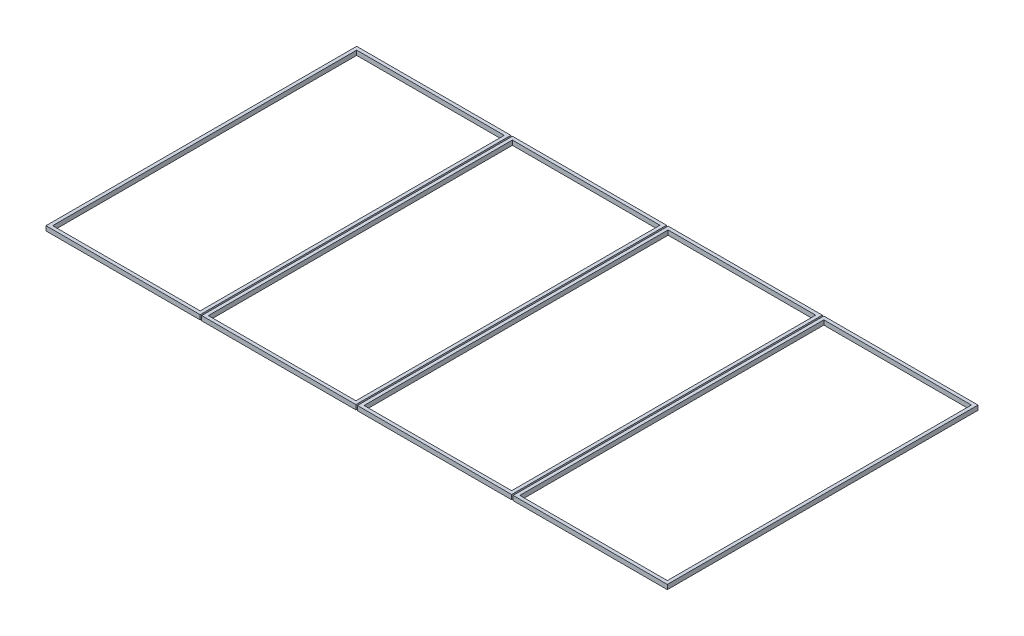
from build123d import *

# Parameters (mm, degrees)
SKETCH1_W            = 579.5
SKETCH1_H            = 1194
BOSS_EXTRU_1_DEPTH   = 18
BOSS_EXTRU_1_2_DEPTH = 18
BOSS_EXTRU_1_3_DEPTH = 18
BOSS_EXTRU_1_4_DEPTH = 18


with BuildPart() as part:
    # Sketch1 → Boss.-Extru.1 (new body)
    with BuildSketch(Plane(origin=(0, 0, 0), x_dir=(1, 0, 0), z_dir=(0, 1, 0))):
        Polygon((0, 0), (0, 1220), (605.5, 1220), (605.5, 0), (592.5, 0), (13, 0), align=None)
        with Locations((302.75, 610)):
            Rectangle(SKETCH1_W, SKETCH1_H, mode=Mode.SUBTRACT)
    extrude(amount=BOSS_EXTRU_1_DEPTH)


with BuildPart() as body_2:
    # Sketch1 → Boss.-Extru.1 2 (new body)
    with BuildSketch(Plane(origin=(0, 0, 0), x_dir=(1, 0, 0), z_dir=(0, 1, 0))):
        Polygon((2440, 0), (2440, 1220), (1834.5, 1220), (1834.5, 0), (1847.5, 0), (2427, 0), align=None)
        with Locations((2137.25, 610)):
            Rectangle(SKETCH1_W, SKETCH1_H, mode=Mode.SUBTRACT)
    extrude(amount=BOSS_EXTRU_1_2_DEPTH)


with BuildPart() as body_3:
    # Sketch1 → Boss.-Extru.1 3 (new body)
    with BuildSketch(Plane(origin=(0, 0, 0), x_dir=(1, 0, 0), z_dir=(0, 1, 0))):
        Polygon((624.5, 0), (1204, 0), (1217, 0), (1217, 1220), (611.5, 1220), (611.5, 0), align=None)
        with Locations((914.25, 610)):
            Rectangle(SKETCH1_W, SKETCH1_H, mode=Mode.SUBTRACT)
    extrude(amount=BOSS_EXTRU_1_3_DEPTH)


with BuildPart() as body_4:
    # Sketch1 → Boss.-Extru.1 4 (new body)
    with BuildSketch(Plane(origin=(0, 0, 0), x_dir=(1, 0, 0), z_dir=(0, 1, 0))):
        Polygon((1236, 0), (1815.5, 0), (1828.5, 0), (1828.5, 1220), (1223, 1220), (1223, 0), align=None)
        with Locations((1525.75, 610)):
            Rectangle(SKETCH1_W, SKETCH1_H, mode=Mode.SUBTRACT)
    extrude(amount=BOSS_EXTRU_1_4_DEPTH)


solid = Compound([part.part, body_2.part, body_3.part, body_4.part])
